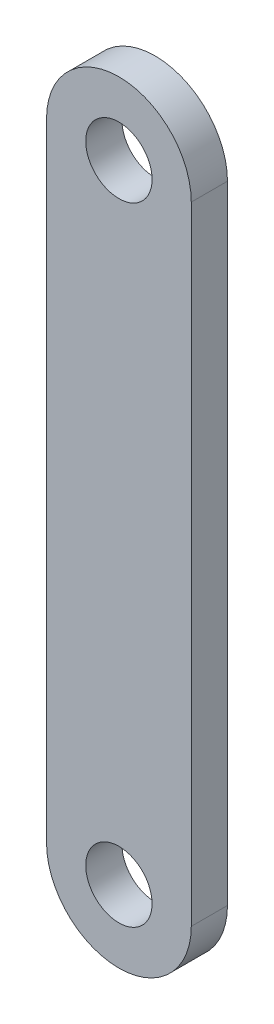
ISO-10303-21;
HEADER;
FILE_DESCRIPTION(('STEP AP214'),'2;1');
FILE_NAME('part.step','',(''),(''),'','','');
FILE_SCHEMA(('AUTOMOTIVE_DESIGN { 1 0 10303 214 1 1 1 1 }'));
ENDSEC;
DATA;
#1=APPLICATION_CONTEXT('core data for automotive mechanical design processes');
#2=APPLICATION_PROTOCOL_DEFINITION('international standard','automotive_design',2000,#1);
#3=PRODUCT_CONTEXT('',#1,'mechanical');
#4=PRODUCT('Part','Part','',(#3));
#5=PRODUCT_RELATED_PRODUCT_CATEGORY('part','',(#4));
#6=PRODUCT_DEFINITION_FORMATION('','',#4);
#7=PRODUCT_DEFINITION_CONTEXT('part definition',#1,'design');
#8=PRODUCT_DEFINITION('design','',#6,#7);
#9=PRODUCT_DEFINITION_SHAPE('','',#8);
#10=(LENGTH_UNIT() NAMED_UNIT(*) SI_UNIT(.MILLI.,.METRE.));
#11=(NAMED_UNIT(*) PLANE_ANGLE_UNIT() SI_UNIT($,.RADIAN.));
#12=(NAMED_UNIT(*) SI_UNIT($,.STERADIAN.) SOLID_ANGLE_UNIT());
#13=UNCERTAINTY_MEASURE_WITH_UNIT(LENGTH_MEASURE(1.E-05),#10,'distance_accuracy_value','');
#14=(GEOMETRIC_REPRESENTATION_CONTEXT(3) GLOBAL_UNCERTAINTY_ASSIGNED_CONTEXT((#13)) GLOBAL_UNIT_ASSIGNED_CONTEXT((#10,
#11,#12)) REPRESENTATION_CONTEXT('',''));
#15=CARTESIAN_POINT('',(0.,0.,0.));
#16=DIRECTION('',(0.,0.,1.));
#17=DIRECTION('',(1.,0.,0.));
#18=AXIS2_PLACEMENT_3D('',#15,#16,#17);
#19=CARTESIAN_POINT('',(1.35680022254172E-13,41.275,4.7625));
#20=DIRECTION('',(0.,0.,1.));
#21=DIRECTION('',(1.,0.,0.));
#22=AXIS2_PLACEMENT_3D('',#19,#20,#21);
#23=PLANE('',#22);
#24=CARTESIAN_POINT('',(1.35680022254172E-13,41.275,4.7625));
#25=DIRECTION('',(0.,0.,1.));
#26=DIRECTION('',(1.,0.,0.));
#27=AXIS2_PLACEMENT_3D('',#24,#25,#26);
#28=CIRCLE('',#27,4.365625);
#29=CARTESIAN_POINT('',(4.36562500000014,41.275,4.7625));
#30=VERTEX_POINT('',#29);
#31=EDGE_CURVE('E101',#30,#30,#28,.T.);
#32=ORIENTED_EDGE('',*,*,#31,.F.);
#33=EDGE_LOOP('',(#32));
#34=FACE_BOUND('',#33,.T.);
#35=CARTESIAN_POINT('',(1.35680022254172E-13,41.275,4.7625));
#36=DIRECTION('',(0.,0.,1.));
#37=DIRECTION('',(1.,0.,0.));
#38=AXIS2_PLACEMENT_3D('',#35,#36,#37);
#39=CIRCLE('',#38,9.52500000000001);
#40=CARTESIAN_POINT('',(9.52500000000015,41.275,4.7625));
#41=VERTEX_POINT('',#40);
#42=CARTESIAN_POINT('',(-9.52499999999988,41.275,4.7625));
#43=VERTEX_POINT('',#42);
#44=EDGE_CURVE('E86',#41,#43,#39,.T.);
#45=ORIENTED_EDGE('',*,*,#44,.T.);
#46=DIRECTION('',(0.,-1.,0.));
#47=VECTOR('',#46,1.);
#48=CARTESIAN_POINT('',(-9.52499999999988,41.275,4.7625));
#49=LINE('',#48,#47);
#50=CARTESIAN_POINT('',(-9.52500000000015,-41.275,4.7625));
#51=VERTEX_POINT('',#50);
#52=EDGE_CURVE('E81',#43,#51,#49,.T.);
#53=ORIENTED_EDGE('',*,*,#52,.T.);
#54=CARTESIAN_POINT('',(-1.46638257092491E-13,-41.275,4.7625));
#55=DIRECTION('',(0.,0.,1.));
#56=DIRECTION('',(1.,0.,0.));
#57=AXIS2_PLACEMENT_3D('',#54,#55,#56);
#58=CIRCLE('',#57,9.52500000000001);
#59=CARTESIAN_POINT('',(9.52499999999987,-41.275,4.7625));
#60=VERTEX_POINT('',#59);
#61=EDGE_CURVE('E84',#51,#60,#58,.T.);
#62=ORIENTED_EDGE('',*,*,#61,.T.);
#63=DIRECTION('',(0.,1.,0.));
#64=VECTOR('',#63,1.);
#65=CARTESIAN_POINT('',(9.52500000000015,41.275,4.7625));
#66=LINE('',#65,#64);
#67=EDGE_CURVE('E51',#60,#41,#66,.T.);
#68=ORIENTED_EDGE('',*,*,#67,.T.);
#69=EDGE_LOOP('',(#45,#53,#62,#68));
#70=FACE_BOUND('',#69,.T.);
#71=CARTESIAN_POINT('',(-1.46638257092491E-13,-41.275,4.7625));
#72=DIRECTION('',(0.,0.,1.));
#73=DIRECTION('',(1.,0.,0.));
#74=AXIS2_PLACEMENT_3D('',#71,#72,#73);
#75=CIRCLE('',#74,4.365625);
#76=CARTESIAN_POINT('',(4.36562499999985,-41.275,4.7625));
#77=VERTEX_POINT('',#76);
#78=EDGE_CURVE('E116',#77,#77,#75,.T.);
#79=ORIENTED_EDGE('',*,*,#78,.F.);
#80=EDGE_LOOP('',(#79));
#81=FACE_BOUND('',#80,.T.);
#82=ADVANCED_FACE('F34',(#34,#70,#81),#23,.T.);
#83=CARTESIAN_POINT('',(1.35680022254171E-13,41.275,0.));
#84=DIRECTION('',(0.,0.,1.));
#85=DIRECTION('',(1.,0.,0.));
#86=AXIS2_PLACEMENT_3D('',#83,#84,#85);
#87=PLANE('',#86);
#88=CARTESIAN_POINT('',(1.35680022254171E-13,41.275,0.));
#89=DIRECTION('',(0.,0.,1.));
#90=DIRECTION('',(1.,0.,0.));
#91=AXIS2_PLACEMENT_3D('',#88,#89,#90);
#92=CIRCLE('',#91,4.365625);
#93=CARTESIAN_POINT('',(4.36562500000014,41.275,0.));
#94=VERTEX_POINT('',#93);
#95=EDGE_CURVE('E113',#94,#94,#92,.T.);
#96=ORIENTED_EDGE('',*,*,#95,.T.);
#97=EDGE_LOOP('',(#96));
#98=FACE_BOUND('',#97,.T.);
#99=CARTESIAN_POINT('',(1.35680022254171E-13,41.275,0.));
#100=DIRECTION('',(0.,0.,1.));
#101=DIRECTION('',(1.,0.,0.));
#102=AXIS2_PLACEMENT_3D('',#99,#100,#101);
#103=CIRCLE('',#102,9.52500000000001);
#104=CARTESIAN_POINT('',(9.52500000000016,41.275,0.));
#105=VERTEX_POINT('',#104);
#106=CARTESIAN_POINT('',(-9.52499999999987,41.275,0.));
#107=VERTEX_POINT('',#106);
#108=EDGE_CURVE('E98',#105,#107,#103,.T.);
#109=ORIENTED_EDGE('',*,*,#108,.F.);
#110=DIRECTION('',(0.,1.,0.));
#111=VECTOR('',#110,1.);
#112=CARTESIAN_POINT('',(9.52500000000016,41.275,0.));
#113=LINE('',#112,#111);
#114=CARTESIAN_POINT('',(9.52499999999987,-41.275,0.));
#115=VERTEX_POINT('',#114);
#116=EDGE_CURVE('E74',#115,#105,#113,.T.);
#117=ORIENTED_EDGE('',*,*,#116,.F.);
#118=CARTESIAN_POINT('',(-1.46638257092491E-13,-41.275,0.));
#119=DIRECTION('',(0.,0.,1.));
#120=DIRECTION('',(1.,0.,0.));
#121=AXIS2_PLACEMENT_3D('',#118,#119,#120);
#122=CIRCLE('',#121,9.52500000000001);
#123=CARTESIAN_POINT('',(-9.52500000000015,-41.275,0.));
#124=VERTEX_POINT('',#123);
#125=EDGE_CURVE('E68',#124,#115,#122,.T.);
#126=ORIENTED_EDGE('',*,*,#125,.F.);
#127=DIRECTION('',(0.,-1.,0.));
#128=VECTOR('',#127,1.);
#129=CARTESIAN_POINT('',(-9.52499999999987,41.275,0.));
#130=LINE('',#129,#128);
#131=EDGE_CURVE('E90',#107,#124,#130,.T.);
#132=ORIENTED_EDGE('',*,*,#131,.F.);
#133=EDGE_LOOP('',(#109,#117,#126,#132));
#134=FACE_BOUND('',#133,.T.);
#135=CARTESIAN_POINT('',(-1.46638257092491E-13,-41.275,0.));
#136=DIRECTION('',(0.,0.,1.));
#137=DIRECTION('',(1.,0.,0.));
#138=AXIS2_PLACEMENT_3D('',#135,#136,#137);
#139=CIRCLE('',#138,4.365625);
#140=CARTESIAN_POINT('',(4.36562499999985,-41.275,0.));
#141=VERTEX_POINT('',#140);
#142=EDGE_CURVE('E119',#141,#141,#139,.T.);
#143=ORIENTED_EDGE('',*,*,#142,.T.);
#144=EDGE_LOOP('',(#143));
#145=FACE_BOUND('',#144,.T.);
#146=ADVANCED_FACE('F109',(#98,#134,#145),#87,.F.);
#147=CARTESIAN_POINT('',(1.35680022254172E-13,41.275,4.7625));
#148=DIRECTION('',(0.,0.,-1.));
#149=DIRECTION('',(-1.,0.,0.));
#150=AXIS2_PLACEMENT_3D('',#147,#148,#149);
#151=CYLINDRICAL_SURFACE('',#150,9.52500000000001);
#152=ORIENTED_EDGE('',*,*,#108,.T.);
#153=DIRECTION('',(0.,0.,-1.));
#154=VECTOR('',#153,1.);
#155=CARTESIAN_POINT('',(-9.52499999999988,41.275,4.7625));
#156=LINE('',#155,#154);
#157=EDGE_CURVE('E11',#43,#107,#156,.T.);
#158=ORIENTED_EDGE('',*,*,#157,.F.);
#159=ORIENTED_EDGE('',*,*,#44,.F.);
#160=DIRECTION('',(0.,0.,-1.));
#161=VECTOR('',#160,1.);
#162=CARTESIAN_POINT('',(9.52500000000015,41.275,4.7625));
#163=LINE('',#162,#161);
#164=EDGE_CURVE('E94',#41,#105,#163,.T.);
#165=ORIENTED_EDGE('',*,*,#164,.T.);
#166=EDGE_LOOP('',(#152,#158,#159,#165));
#167=FACE_BOUND('',#166,.T.);
#168=ADVANCED_FACE('F36',(#167),#151,.T.);
#169=CARTESIAN_POINT('',(-9.52499999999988,41.275,4.7625));
#170=DIRECTION('',(1.,0.,0.));
#171=DIRECTION('',(0.,1.,0.));
#172=AXIS2_PLACEMENT_3D('',#169,#170,#171);
#173=PLANE('',#172);
#174=ORIENTED_EDGE('',*,*,#131,.T.);
#175=DIRECTION('',(0.,0.,-1.));
#176=VECTOR('',#175,1.);
#177=CARTESIAN_POINT('',(-9.52500000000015,-41.275,4.7625));
#178=LINE('',#177,#176);
#179=EDGE_CURVE('E43',#51,#124,#178,.T.);
#180=ORIENTED_EDGE('',*,*,#179,.F.);
#181=ORIENTED_EDGE('',*,*,#52,.F.);
#182=ORIENTED_EDGE('',*,*,#157,.T.);
#183=EDGE_LOOP('',(#174,#180,#181,#182));
#184=FACE_BOUND('',#183,.T.);
#185=ADVANCED_FACE('F89',(#184),#173,.F.);
#186=CARTESIAN_POINT('',(-1.46638257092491E-13,-41.275,4.7625));
#187=DIRECTION('',(0.,0.,-1.));
#188=DIRECTION('',(-1.,0.,0.));
#189=AXIS2_PLACEMENT_3D('',#186,#187,#188);
#190=CYLINDRICAL_SURFACE('',#189,9.52500000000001);
#191=ORIENTED_EDGE('',*,*,#125,.T.);
#192=DIRECTION('',(0.,0.,-1.));
#193=VECTOR('',#192,1.);
#194=CARTESIAN_POINT('',(9.52499999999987,-41.275,4.7625));
#195=LINE('',#194,#193);
#196=EDGE_CURVE('E91',#60,#115,#195,.T.);
#197=ORIENTED_EDGE('',*,*,#196,.F.);
#198=ORIENTED_EDGE('',*,*,#61,.F.);
#199=ORIENTED_EDGE('',*,*,#179,.T.);
#200=EDGE_LOOP('',(#191,#197,#198,#199));
#201=FACE_BOUND('',#200,.T.);
#202=ADVANCED_FACE('F92',(#201),#190,.T.);
#203=CARTESIAN_POINT('',(9.52500000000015,41.275,4.7625));
#204=DIRECTION('',(-1.,0.,0.));
#205=DIRECTION('',(0.,-1.,0.));
#206=AXIS2_PLACEMENT_3D('',#203,#204,#205);
#207=PLANE('',#206);
#208=ORIENTED_EDGE('',*,*,#116,.T.);
#209=ORIENTED_EDGE('',*,*,#164,.F.);
#210=ORIENTED_EDGE('',*,*,#67,.F.);
#211=ORIENTED_EDGE('',*,*,#196,.T.);
#212=EDGE_LOOP('',(#208,#209,#210,#211));
#213=FACE_BOUND('',#212,.T.);
#214=ADVANCED_FACE('F106',(#213),#207,.F.);
#215=CARTESIAN_POINT('',(1.35680022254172E-13,41.275,4.7625));
#216=DIRECTION('',(0.,0.,-1.));
#217=DIRECTION('',(-1.,0.,0.));
#218=AXIS2_PLACEMENT_3D('',#215,#216,#217);
#219=CYLINDRICAL_SURFACE('',#218,4.365625);
#220=ORIENTED_EDGE('',*,*,#31,.T.);
#221=EDGE_LOOP('',(#220));
#222=FACE_BOUND('',#221,.T.);
#223=ORIENTED_EDGE('',*,*,#95,.F.);
#224=EDGE_LOOP('',(#223));
#225=FACE_BOUND('',#224,.T.);
#226=ADVANCED_FACE('F137',(#222,#225),#219,.F.);
#227=CARTESIAN_POINT('',(-1.46638257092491E-13,-41.275,4.7625));
#228=DIRECTION('',(0.,0.,-1.));
#229=DIRECTION('',(-1.,0.,0.));
#230=AXIS2_PLACEMENT_3D('',#227,#228,#229);
#231=CYLINDRICAL_SURFACE('',#230,4.365625);
#232=ORIENTED_EDGE('',*,*,#78,.T.);
#233=EDGE_LOOP('',(#232));
#234=FACE_BOUND('',#233,.T.);
#235=ORIENTED_EDGE('',*,*,#142,.F.);
#236=EDGE_LOOP('',(#235));
#237=FACE_BOUND('',#236,.T.);
#238=ADVANCED_FACE('F125',(#234,#237),#231,.F.);
#239=CLOSED_SHELL('',(#82,#146,#168,#185,#202,#214,#226,#238));
#240=MANIFOLD_SOLID_BREP('B2',#239);
#241=ADVANCED_BREP_SHAPE_REPRESENTATION('',(#18,#240),#14);
#242=SHAPE_DEFINITION_REPRESENTATION(#9,#241);
ENDSEC;
END-ISO-10303-21;
